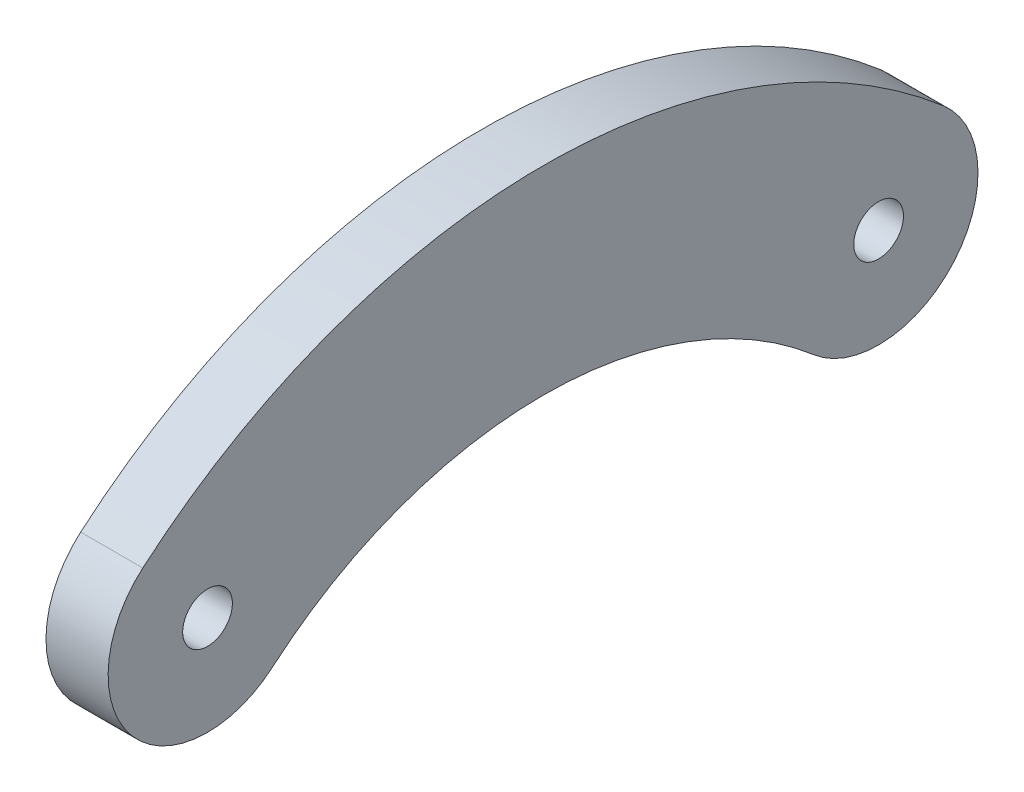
ISO-10303-21;
HEADER;
FILE_DESCRIPTION(('STEP AP214'),'2;1');
FILE_NAME('part.step','',(''),(''),'','','');
FILE_SCHEMA(('AUTOMOTIVE_DESIGN { 1 0 10303 214 1 1 1 1 }'));
ENDSEC;
DATA;
#1=APPLICATION_CONTEXT('core data for automotive mechanical design processes');
#2=APPLICATION_PROTOCOL_DEFINITION('international standard','automotive_design',2000,#1);
#3=PRODUCT_CONTEXT('',#1,'mechanical');
#4=PRODUCT('Part','Part','',(#3));
#5=PRODUCT_RELATED_PRODUCT_CATEGORY('part','',(#4));
#6=PRODUCT_DEFINITION_FORMATION('','',#4);
#7=PRODUCT_DEFINITION_CONTEXT('part definition',#1,'design');
#8=PRODUCT_DEFINITION('design','',#6,#7);
#9=PRODUCT_DEFINITION_SHAPE('','',#8);
#10=(LENGTH_UNIT() NAMED_UNIT(*) SI_UNIT(.MILLI.,.METRE.));
#11=(NAMED_UNIT(*) PLANE_ANGLE_UNIT() SI_UNIT($,.RADIAN.));
#12=(NAMED_UNIT(*) SI_UNIT($,.STERADIAN.) SOLID_ANGLE_UNIT());
#13=UNCERTAINTY_MEASURE_WITH_UNIT(LENGTH_MEASURE(1.E-05),#10,'distance_accuracy_value','');
#14=(GEOMETRIC_REPRESENTATION_CONTEXT(3) GLOBAL_UNCERTAINTY_ASSIGNED_CONTEXT((#13)) GLOBAL_UNIT_ASSIGNED_CONTEXT((#10,
#11,#12)) REPRESENTATION_CONTEXT('',''));
#15=CARTESIAN_POINT('',(0.,0.,0.));
#16=DIRECTION('',(0.,0.,1.));
#17=DIRECTION('',(1.,0.,0.));
#18=AXIS2_PLACEMENT_3D('',#15,#16,#17);
#19=CARTESIAN_POINT('',(1.25,-7.8625,-20.25));
#20=DIRECTION('',(1.,0.,0.));
#21=DIRECTION('',(0.,0.,-1.));
#22=AXIS2_PLACEMENT_3D('',#19,#20,#21);
#23=PLANE('',#22);
#24=CARTESIAN_POINT('',(1.25,0.,0.));
#25=DIRECTION('',(1.,0.,0.));
#26=DIRECTION('',(0.,0.,-1.));
#27=AXIS2_PLACEMENT_3D('',#24,#25,#26);
#28=CIRCLE('',#27,1.);
#29=CARTESIAN_POINT('',(1.25,0.,-1.));
#30=VERTEX_POINT('',#29);
#31=EDGE_CURVE('E101',#30,#30,#28,.T.);
#32=ORIENTED_EDGE('',*,*,#31,.F.);
#33=EDGE_LOOP('',(#32));
#34=FACE_BOUND('',#33,.T.);
#35=CARTESIAN_POINT('',(1.25,0.,-27.));
#36=DIRECTION('',(1.,0.,0.));
#37=DIRECTION('',(0.,0.,-1.));
#38=AXIS2_PLACEMENT_3D('',#35,#36,#37);
#39=CIRCLE('',#38,4.);
#40=CARTESIAN_POINT('',(1.25,-3.03498190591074,-24.394451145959));
#41=VERTEX_POINT('',#40);
#42=CARTESIAN_POINT('',(1.25,3.03498190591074,-29.605548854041));
#43=VERTEX_POINT('',#42);
#44=EDGE_CURVE('E86',#41,#43,#39,.T.);
#45=ORIENTED_EDGE('',*,*,#44,.T.);
#46=CARTESIAN_POINT('',(1.25,-15.725,-13.5));
#47=DIRECTION('',(1.,0.,0.));
#48=DIRECTION('',(0.,0.,-1.));
#49=AXIS2_PLACEMENT_3D('',#46,#47,#48);
#50=CIRCLE('',#49,24.725);
#51=CARTESIAN_POINT('',(1.25,3.03498190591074,2.60554885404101));
#52=VERTEX_POINT('',#51);
#53=EDGE_CURVE('E81',#43,#52,#50,.T.);
#54=ORIENTED_EDGE('',*,*,#53,.T.);
#55=CARTESIAN_POINT('',(1.25,0.,0.));
#56=DIRECTION('',(1.,0.,0.));
#57=DIRECTION('',(0.,0.,-1.));
#58=AXIS2_PLACEMENT_3D('',#55,#56,#57);
#59=CIRCLE('',#58,4.);
#60=CARTESIAN_POINT('',(1.25,-3.03498190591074,-2.60554885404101));
#61=VERTEX_POINT('',#60);
#62=EDGE_CURVE('E84',#52,#61,#59,.T.);
#63=ORIENTED_EDGE('',*,*,#62,.T.);
#64=CARTESIAN_POINT('',(1.25,-15.725,-13.5));
#65=DIRECTION('',(-1.,0.,0.));
#66=DIRECTION('',(0.,0.,-1.));
#67=AXIS2_PLACEMENT_3D('',#64,#65,#66);
#68=CIRCLE('',#67,16.725);
#69=EDGE_CURVE('E51',#61,#41,#68,.T.);
#70=ORIENTED_EDGE('',*,*,#69,.T.);
#71=EDGE_LOOP('',(#45,#54,#63,#70));
#72=FACE_BOUND('',#71,.T.);
#73=CARTESIAN_POINT('',(1.25,0.,-27.));
#74=DIRECTION('',(1.,0.,0.));
#75=DIRECTION('',(0.,0.,-1.));
#76=AXIS2_PLACEMENT_3D('',#73,#74,#75);
#77=CIRCLE('',#76,1.);
#78=CARTESIAN_POINT('',(1.25,0.,-28.));
#79=VERTEX_POINT('',#78);
#80=EDGE_CURVE('E116',#79,#79,#77,.T.);
#81=ORIENTED_EDGE('',*,*,#80,.F.);
#82=EDGE_LOOP('',(#81));
#83=FACE_BOUND('',#82,.T.);
#84=ADVANCED_FACE('F34',(#34,#72,#83),#23,.T.);
#85=CARTESIAN_POINT('',(-1.25,-7.8625,-20.25));
#86=DIRECTION('',(1.,0.,0.));
#87=DIRECTION('',(0.,0.,-1.));
#88=AXIS2_PLACEMENT_3D('',#85,#86,#87);
#89=PLANE('',#88);
#90=CARTESIAN_POINT('',(-1.25,0.,0.));
#91=DIRECTION('',(1.,0.,0.));
#92=DIRECTION('',(0.,0.,-1.));
#93=AXIS2_PLACEMENT_3D('',#90,#91,#92);
#94=CIRCLE('',#93,1.);
#95=CARTESIAN_POINT('',(-1.25,0.,-1.));
#96=VERTEX_POINT('',#95);
#97=EDGE_CURVE('E113',#96,#96,#94,.T.);
#98=ORIENTED_EDGE('',*,*,#97,.T.);
#99=EDGE_LOOP('',(#98));
#100=FACE_BOUND('',#99,.T.);
#101=CARTESIAN_POINT('',(-1.25,0.,-27.));
#102=DIRECTION('',(1.,0.,0.));
#103=DIRECTION('',(0.,0.,-1.));
#104=AXIS2_PLACEMENT_3D('',#101,#102,#103);
#105=CIRCLE('',#104,4.);
#106=CARTESIAN_POINT('',(-1.25,-3.03498190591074,-24.394451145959));
#107=VERTEX_POINT('',#106);
#108=CARTESIAN_POINT('',(-1.25,3.03498190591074,-29.605548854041));
#109=VERTEX_POINT('',#108);
#110=EDGE_CURVE('E98',#107,#109,#105,.T.);
#111=ORIENTED_EDGE('',*,*,#110,.F.);
#112=CARTESIAN_POINT('',(-1.25,-15.725,-13.5));
#113=DIRECTION('',(-1.,0.,0.));
#114=DIRECTION('',(0.,0.,-1.));
#115=AXIS2_PLACEMENT_3D('',#112,#113,#114);
#116=CIRCLE('',#115,16.725);
#117=CARTESIAN_POINT('',(-1.25,-3.03498190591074,-2.60554885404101));
#118=VERTEX_POINT('',#117);
#119=EDGE_CURVE('E74',#118,#107,#116,.T.);
#120=ORIENTED_EDGE('',*,*,#119,.F.);
#121=CARTESIAN_POINT('',(-1.25,0.,0.));
#122=DIRECTION('',(1.,0.,0.));
#123=DIRECTION('',(0.,0.,-1.));
#124=AXIS2_PLACEMENT_3D('',#121,#122,#123);
#125=CIRCLE('',#124,4.);
#126=CARTESIAN_POINT('',(-1.25,3.03498190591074,2.60554885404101));
#127=VERTEX_POINT('',#126);
#128=EDGE_CURVE('E68',#127,#118,#125,.T.);
#129=ORIENTED_EDGE('',*,*,#128,.F.);
#130=CARTESIAN_POINT('',(-1.25,-15.725,-13.5));
#131=DIRECTION('',(1.,0.,0.));
#132=DIRECTION('',(0.,0.,-1.));
#133=AXIS2_PLACEMENT_3D('',#130,#131,#132);
#134=CIRCLE('',#133,24.725);
#135=EDGE_CURVE('E90',#109,#127,#134,.T.);
#136=ORIENTED_EDGE('',*,*,#135,.F.);
#137=EDGE_LOOP('',(#111,#120,#129,#136));
#138=FACE_BOUND('',#137,.T.);
#139=CARTESIAN_POINT('',(-1.25,0.,-27.));
#140=DIRECTION('',(1.,0.,0.));
#141=DIRECTION('',(0.,0.,-1.));
#142=AXIS2_PLACEMENT_3D('',#139,#140,#141);
#143=CIRCLE('',#142,1.);
#144=CARTESIAN_POINT('',(-1.25,0.,-28.));
#145=VERTEX_POINT('',#144);
#146=EDGE_CURVE('E119',#145,#145,#143,.T.);
#147=ORIENTED_EDGE('',*,*,#146,.T.);
#148=EDGE_LOOP('',(#147));
#149=FACE_BOUND('',#148,.T.);
#150=ADVANCED_FACE('F109',(#100,#138,#149),#89,.F.);
#151=CARTESIAN_POINT('',(1.25,0.,-27.));
#152=DIRECTION('',(-1.,0.,0.));
#153=DIRECTION('',(0.,0.,1.));
#154=AXIS2_PLACEMENT_3D('',#151,#152,#153);
#155=CYLINDRICAL_SURFACE('',#154,4.);
#156=ORIENTED_EDGE('',*,*,#110,.T.);
#157=DIRECTION('',(-1.,0.,0.));
#158=VECTOR('',#157,1.);
#159=CARTESIAN_POINT('',(1.25,3.03498190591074,-29.605548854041));
#160=LINE('',#159,#158);
#161=EDGE_CURVE('E11',#43,#109,#160,.T.);
#162=ORIENTED_EDGE('',*,*,#161,.F.);
#163=ORIENTED_EDGE('',*,*,#44,.F.);
#164=DIRECTION('',(-1.,0.,0.));
#165=VECTOR('',#164,1.);
#166=CARTESIAN_POINT('',(1.25,-3.03498190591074,-24.394451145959));
#167=LINE('',#166,#165);
#168=EDGE_CURVE('E94',#41,#107,#167,.T.);
#169=ORIENTED_EDGE('',*,*,#168,.T.);
#170=EDGE_LOOP('',(#156,#162,#163,#169));
#171=FACE_BOUND('',#170,.T.);
#172=ADVANCED_FACE('F36',(#171),#155,.T.);
#173=CARTESIAN_POINT('',(1.25,-15.725,-13.5));
#174=DIRECTION('',(-1.,0.,0.));
#175=DIRECTION('',(0.,0.,1.));
#176=AXIS2_PLACEMENT_3D('',#173,#174,#175);
#177=CYLINDRICAL_SURFACE('',#176,24.725);
#178=ORIENTED_EDGE('',*,*,#135,.T.);
#179=DIRECTION('',(-1.,0.,0.));
#180=VECTOR('',#179,1.);
#181=CARTESIAN_POINT('',(1.25,3.03498190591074,2.60554885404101));
#182=LINE('',#181,#180);
#183=EDGE_CURVE('E43',#52,#127,#182,.T.);
#184=ORIENTED_EDGE('',*,*,#183,.F.);
#185=ORIENTED_EDGE('',*,*,#53,.F.);
#186=ORIENTED_EDGE('',*,*,#161,.T.);
#187=EDGE_LOOP('',(#178,#184,#185,#186));
#188=FACE_BOUND('',#187,.T.);
#189=ADVANCED_FACE('F89',(#188),#177,.T.);
#190=CARTESIAN_POINT('',(1.25,0.,0.));
#191=DIRECTION('',(-1.,0.,0.));
#192=DIRECTION('',(0.,0.,1.));
#193=AXIS2_PLACEMENT_3D('',#190,#191,#192);
#194=CYLINDRICAL_SURFACE('',#193,4.);
#195=ORIENTED_EDGE('',*,*,#128,.T.);
#196=DIRECTION('',(-1.,0.,0.));
#197=VECTOR('',#196,1.);
#198=CARTESIAN_POINT('',(1.25,-3.03498190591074,-2.60554885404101));
#199=LINE('',#198,#197);
#200=EDGE_CURVE('E91',#61,#118,#199,.T.);
#201=ORIENTED_EDGE('',*,*,#200,.F.);
#202=ORIENTED_EDGE('',*,*,#62,.F.);
#203=ORIENTED_EDGE('',*,*,#183,.T.);
#204=EDGE_LOOP('',(#195,#201,#202,#203));
#205=FACE_BOUND('',#204,.T.);
#206=ADVANCED_FACE('F92',(#205),#194,.T.);
#207=CARTESIAN_POINT('',(1.25,-15.725,-13.5));
#208=DIRECTION('',(-1.,0.,0.));
#209=DIRECTION('',(0.,0.,1.));
#210=AXIS2_PLACEMENT_3D('',#207,#208,#209);
#211=CYLINDRICAL_SURFACE('',#210,16.725);
#212=ORIENTED_EDGE('',*,*,#119,.T.);
#213=ORIENTED_EDGE('',*,*,#168,.F.);
#214=ORIENTED_EDGE('',*,*,#69,.F.);
#215=ORIENTED_EDGE('',*,*,#200,.T.);
#216=EDGE_LOOP('',(#212,#213,#214,#215));
#217=FACE_BOUND('',#216,.T.);
#218=ADVANCED_FACE('F106',(#217),#211,.F.);
#219=CARTESIAN_POINT('',(1.25,0.,0.));
#220=DIRECTION('',(-1.,0.,0.));
#221=DIRECTION('',(0.,0.,1.));
#222=AXIS2_PLACEMENT_3D('',#219,#220,#221);
#223=CYLINDRICAL_SURFACE('',#222,1.);
#224=ORIENTED_EDGE('',*,*,#31,.T.);
#225=EDGE_LOOP('',(#224));
#226=FACE_BOUND('',#225,.T.);
#227=ORIENTED_EDGE('',*,*,#97,.F.);
#228=EDGE_LOOP('',(#227));
#229=FACE_BOUND('',#228,.T.);
#230=ADVANCED_FACE('F137',(#226,#229),#223,.F.);
#231=CARTESIAN_POINT('',(1.25,0.,-27.));
#232=DIRECTION('',(-1.,0.,0.));
#233=DIRECTION('',(0.,0.,1.));
#234=AXIS2_PLACEMENT_3D('',#231,#232,#233);
#235=CYLINDRICAL_SURFACE('',#234,1.);
#236=ORIENTED_EDGE('',*,*,#80,.T.);
#237=EDGE_LOOP('',(#236));
#238=FACE_BOUND('',#237,.T.);
#239=ORIENTED_EDGE('',*,*,#146,.F.);
#240=EDGE_LOOP('',(#239));
#241=FACE_BOUND('',#240,.T.);
#242=ADVANCED_FACE('F125',(#238,#241),#235,.F.);
#243=CLOSED_SHELL('',(#84,#150,#172,#189,#206,#218,#230,#242));
#244=MANIFOLD_SOLID_BREP('B2',#243);
#245=ADVANCED_BREP_SHAPE_REPRESENTATION('',(#18,#244),#14);
#246=SHAPE_DEFINITION_REPRESENTATION(#9,#245);
ENDSEC;
END-ISO-10303-21;
